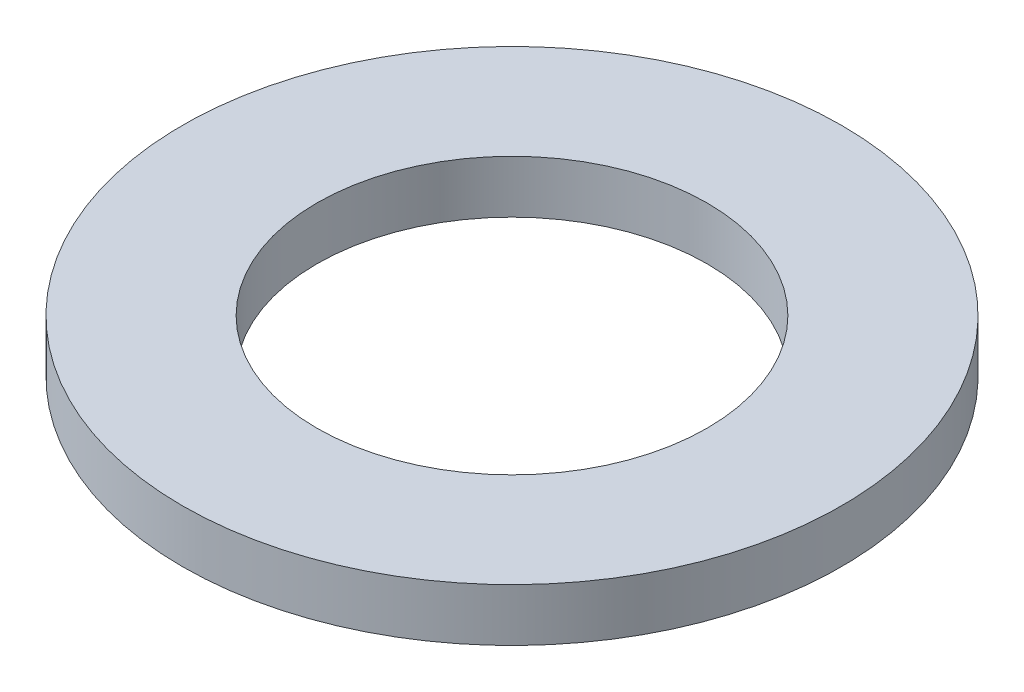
ISO-10303-21;
HEADER;
FILE_DESCRIPTION(('STEP AP214'),'2;1');
FILE_NAME('part.step','',(''),(''),'','','');
FILE_SCHEMA(('AUTOMOTIVE_DESIGN { 1 0 10303 214 1 1 1 1 }'));
ENDSEC;
DATA;
#1=APPLICATION_CONTEXT('core data for automotive mechanical design processes');
#2=APPLICATION_PROTOCOL_DEFINITION('international standard','automotive_design',2000,#1);
#3=PRODUCT_CONTEXT('',#1,'mechanical');
#4=PRODUCT('Part','Part','',(#3));
#5=PRODUCT_RELATED_PRODUCT_CATEGORY('part','',(#4));
#6=PRODUCT_DEFINITION_FORMATION('','',#4);
#7=PRODUCT_DEFINITION_CONTEXT('part definition',#1,'design');
#8=PRODUCT_DEFINITION('design','',#6,#7);
#9=PRODUCT_DEFINITION_SHAPE('','',#8);
#10=(LENGTH_UNIT() NAMED_UNIT(*) SI_UNIT(.MILLI.,.METRE.));
#11=(NAMED_UNIT(*) PLANE_ANGLE_UNIT() SI_UNIT($,.RADIAN.));
#12=(NAMED_UNIT(*) SI_UNIT($,.STERADIAN.) SOLID_ANGLE_UNIT());
#13=UNCERTAINTY_MEASURE_WITH_UNIT(LENGTH_MEASURE(1.E-05),#10,'distance_accuracy_value','');
#14=(GEOMETRIC_REPRESENTATION_CONTEXT(3) GLOBAL_UNCERTAINTY_ASSIGNED_CONTEXT((#13)) GLOBAL_UNIT_ASSIGNED_CONTEXT((#10,
#11,#12)) REPRESENTATION_CONTEXT('',''));
#15=CARTESIAN_POINT('',(0.,0.,0.));
#16=DIRECTION('',(0.,0.,1.));
#17=DIRECTION('',(1.,0.,0.));
#18=AXIS2_PLACEMENT_3D('',#15,#16,#17);
#19=CARTESIAN_POINT('',(0.,10.,0.));
#20=DIRECTION('',(0.,1.,0.));
#21=DIRECTION('',(0.,0.,1.));
#22=AXIS2_PLACEMENT_3D('',#19,#20,#21);
#23=PLANE('',#22);
#24=CARTESIAN_POINT('',(0.,10.,0.));
#25=DIRECTION('',(0.,1.,0.));
#26=DIRECTION('',(0.,0.,1.));
#27=AXIS2_PLACEMENT_3D('',#24,#25,#26);
#28=CIRCLE('',#27,62.5);
#29=CARTESIAN_POINT('',(0.,10.,62.5));
#30=VERTEX_POINT('',#29);
#31=EDGE_CURVE('E10',#30,#30,#28,.T.);
#32=ORIENTED_EDGE('',*,*,#31,.T.);
#33=EDGE_LOOP('',(#32));
#34=FACE_BOUND('',#33,.T.);
#35=CARTESIAN_POINT('',(0.,10.,0.));
#36=DIRECTION('',(0.,1.,0.));
#37=DIRECTION('',(0.,0.,1.));
#38=AXIS2_PLACEMENT_3D('',#35,#36,#37);
#39=CIRCLE('',#38,37.);
#40=CARTESIAN_POINT('',(0.,10.,37.));
#41=VERTEX_POINT('',#40);
#42=EDGE_CURVE('E39',#41,#41,#39,.T.);
#43=ORIENTED_EDGE('',*,*,#42,.F.);
#44=EDGE_LOOP('',(#43));
#45=FACE_BOUND('',#44,.T.);
#46=ADVANCED_FACE('F28',(#34,#45),#23,.T.);
#47=CARTESIAN_POINT('',(0.,0.,0.));
#48=DIRECTION('',(0.,1.,0.));
#49=DIRECTION('',(0.,0.,1.));
#50=AXIS2_PLACEMENT_3D('',#47,#48,#49);
#51=PLANE('',#50);
#52=CARTESIAN_POINT('',(0.,0.,0.));
#53=DIRECTION('',(0.,1.,0.));
#54=DIRECTION('',(0.,0.,1.));
#55=AXIS2_PLACEMENT_3D('',#52,#53,#54);
#56=CIRCLE('',#55,62.5);
#57=CARTESIAN_POINT('',(0.,0.,62.5));
#58=VERTEX_POINT('',#57);
#59=EDGE_CURVE('E35',#58,#58,#56,.T.);
#60=ORIENTED_EDGE('',*,*,#59,.F.);
#61=EDGE_LOOP('',(#60));
#62=FACE_BOUND('',#61,.T.);
#63=CARTESIAN_POINT('',(0.,0.,0.));
#64=DIRECTION('',(0.,1.,0.));
#65=DIRECTION('',(0.,0.,1.));
#66=AXIS2_PLACEMENT_3D('',#63,#64,#65);
#67=CIRCLE('',#66,37.);
#68=CARTESIAN_POINT('',(0.,0.,37.));
#69=VERTEX_POINT('',#68);
#70=EDGE_CURVE('E43',#69,#69,#67,.T.);
#71=ORIENTED_EDGE('',*,*,#70,.T.);
#72=EDGE_LOOP('',(#71));
#73=FACE_BOUND('',#72,.T.);
#74=ADVANCED_FACE('F49',(#62,#73),#51,.F.);
#75=CARTESIAN_POINT('',(0.,10.,0.));
#76=DIRECTION('',(0.,-1.,0.));
#77=DIRECTION('',(0.,0.,-1.));
#78=AXIS2_PLACEMENT_3D('',#75,#76,#77);
#79=CYLINDRICAL_SURFACE('',#78,62.5);
#80=ORIENTED_EDGE('',*,*,#31,.F.);
#81=EDGE_LOOP('',(#80));
#82=FACE_BOUND('',#81,.T.);
#83=ORIENTED_EDGE('',*,*,#59,.T.);
#84=EDGE_LOOP('',(#83));
#85=FACE_BOUND('',#84,.T.);
#86=ADVANCED_FACE('F30',(#82,#85),#79,.T.);
#87=CARTESIAN_POINT('',(0.,10.,0.));
#88=DIRECTION('',(0.,-1.,0.));
#89=DIRECTION('',(0.,0.,-1.));
#90=AXIS2_PLACEMENT_3D('',#87,#88,#89);
#91=CYLINDRICAL_SURFACE('',#90,37.);
#92=ORIENTED_EDGE('',*,*,#42,.T.);
#93=EDGE_LOOP('',(#92));
#94=FACE_BOUND('',#93,.T.);
#95=ORIENTED_EDGE('',*,*,#70,.F.);
#96=EDGE_LOOP('',(#95));
#97=FACE_BOUND('',#96,.T.);
#98=ADVANCED_FACE('F51',(#94,#97),#91,.F.);
#99=CLOSED_SHELL('',(#46,#74,#86,#98));
#100=MANIFOLD_SOLID_BREP('B2',#99);
#101=ADVANCED_BREP_SHAPE_REPRESENTATION('',(#18,#100),#14);
#102=SHAPE_DEFINITION_REPRESENTATION(#9,#101);
ENDSEC;
END-ISO-10303-21;
